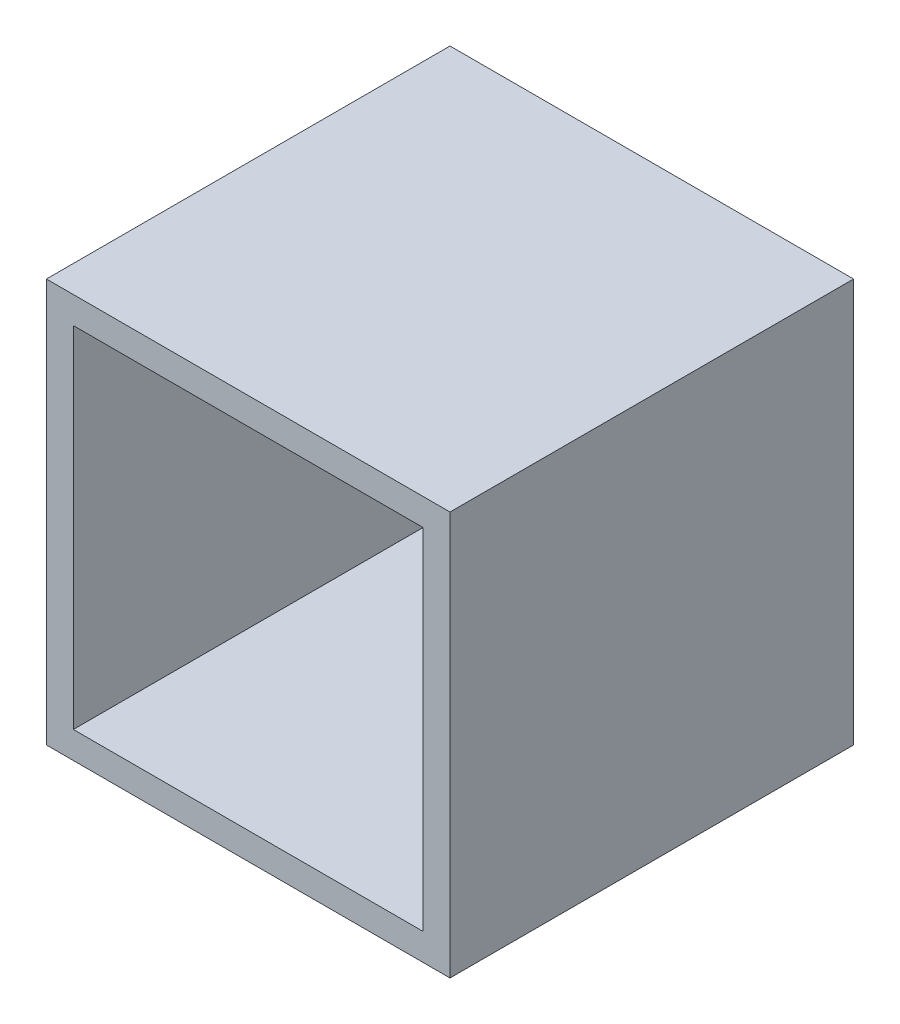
ISO-10303-21;
HEADER;
FILE_DESCRIPTION(('STEP AP214'),'2;1');
FILE_NAME('part.step','',(''),(''),'','','');
FILE_SCHEMA(('AUTOMOTIVE_DESIGN { 1 0 10303 214 1 1 1 1 }'));
ENDSEC;
DATA;
#1=APPLICATION_CONTEXT('core data for automotive mechanical design processes');
#2=APPLICATION_PROTOCOL_DEFINITION('international standard','automotive_design',2000,#1);
#3=PRODUCT_CONTEXT('',#1,'mechanical');
#4=PRODUCT('Part','Part','',(#3));
#5=PRODUCT_RELATED_PRODUCT_CATEGORY('part','',(#4));
#6=PRODUCT_DEFINITION_FORMATION('','',#4);
#7=PRODUCT_DEFINITION_CONTEXT('part definition',#1,'design');
#8=PRODUCT_DEFINITION('design','',#6,#7);
#9=PRODUCT_DEFINITION_SHAPE('','',#8);
#10=(LENGTH_UNIT() NAMED_UNIT(*) SI_UNIT(.MILLI.,.METRE.));
#11=(NAMED_UNIT(*) PLANE_ANGLE_UNIT() SI_UNIT($,.RADIAN.));
#12=(NAMED_UNIT(*) SI_UNIT($,.STERADIAN.) SOLID_ANGLE_UNIT());
#13=UNCERTAINTY_MEASURE_WITH_UNIT(LENGTH_MEASURE(1.E-05),#10,'distance_accuracy_value','');
#14=(GEOMETRIC_REPRESENTATION_CONTEXT(3) GLOBAL_UNCERTAINTY_ASSIGNED_CONTEXT((#13)) GLOBAL_UNIT_ASSIGNED_CONTEXT((#10,
#11,#12)) REPRESENTATION_CONTEXT('',''));
#15=CARTESIAN_POINT('',(0.,0.,0.));
#16=DIRECTION('',(0.,0.,1.));
#17=DIRECTION('',(1.,0.,0.));
#18=AXIS2_PLACEMENT_3D('',#15,#16,#17);
#19=CARTESIAN_POINT('',(0.,0.,300.));
#20=DIRECTION('',(0.,0.,1.));
#21=DIRECTION('',(1.,0.,0.));
#22=AXIS2_PLACEMENT_3D('',#19,#20,#21);
#23=PLANE('',#22);
#24=DIRECTION('',(0.,1.,0.));
#25=VECTOR('',#24,1.);
#26=CARTESIAN_POINT('',(150.,-150.,300.));
#27=LINE('',#26,#25);
#28=CARTESIAN_POINT('',(150.,-150.,300.));
#29=VERTEX_POINT('',#28);
#30=CARTESIAN_POINT('',(150.,150.,300.));
#31=VERTEX_POINT('',#30);
#32=EDGE_CURVE('E137',#29,#31,#27,.T.);
#33=ORIENTED_EDGE('',*,*,#32,.T.);
#34=DIRECTION('',(-1.,0.,0.));
#35=VECTOR('',#34,1.);
#36=CARTESIAN_POINT('',(-150.,150.,300.));
#37=LINE('',#36,#35);
#38=CARTESIAN_POINT('',(-150.,150.,300.));
#39=VERTEX_POINT('',#38);
#40=EDGE_CURVE('E140',#31,#39,#37,.T.);
#41=ORIENTED_EDGE('',*,*,#40,.T.);
#42=DIRECTION('',(0.,-1.,0.));
#43=VECTOR('',#42,1.);
#44=CARTESIAN_POINT('',(-150.,-150.,300.));
#45=LINE('',#44,#43);
#46=CARTESIAN_POINT('',(-150.,-150.,300.));
#47=VERTEX_POINT('',#46);
#48=EDGE_CURVE('E143',#39,#47,#45,.T.);
#49=ORIENTED_EDGE('',*,*,#48,.T.);
#50=DIRECTION('',(1.,0.,0.));
#51=VECTOR('',#50,1.);
#52=CARTESIAN_POINT('',(-150.,-150.,300.));
#53=LINE('',#52,#51);
#54=EDGE_CURVE('E145',#47,#29,#53,.T.);
#55=ORIENTED_EDGE('',*,*,#54,.T.);
#56=EDGE_LOOP('',(#33,#41,#49,#55));
#57=FACE_BOUND('',#56,.T.);
#58=DIRECTION('',(-1.,0.,0.));
#59=VECTOR('',#58,1.);
#60=CARTESIAN_POINT('',(0.,130.,300.));
#61=LINE('',#60,#59);
#62=CARTESIAN_POINT('',(130.,130.,300.));
#63=VERTEX_POINT('',#62);
#64=CARTESIAN_POINT('',(-130.,130.,300.));
#65=VERTEX_POINT('',#64);
#66=EDGE_CURVE('E106',#63,#65,#61,.T.);
#67=ORIENTED_EDGE('',*,*,#66,.F.);
#68=DIRECTION('',(0.,1.,0.));
#69=VECTOR('',#68,1.);
#70=CARTESIAN_POINT('',(130.,0.,300.));
#71=LINE('',#70,#69);
#72=CARTESIAN_POINT('',(130.,-130.,300.));
#73=VERTEX_POINT('',#72);
#74=EDGE_CURVE('E98',#73,#63,#71,.T.);
#75=ORIENTED_EDGE('',*,*,#74,.F.);
#76=DIRECTION('',(1.,0.,0.));
#77=VECTOR('',#76,1.);
#78=CARTESIAN_POINT('',(0.,-130.,300.));
#79=LINE('',#78,#77);
#80=CARTESIAN_POINT('',(-130.,-130.,300.));
#81=VERTEX_POINT('',#80);
#82=EDGE_CURVE('E121',#81,#73,#79,.T.);
#83=ORIENTED_EDGE('',*,*,#82,.F.);
#84=DIRECTION('',(0.,-1.,0.));
#85=VECTOR('',#84,1.);
#86=CARTESIAN_POINT('',(-130.,0.,300.));
#87=LINE('',#86,#85);
#88=EDGE_CURVE('E119',#65,#81,#87,.T.);
#89=ORIENTED_EDGE('',*,*,#88,.F.);
#90=EDGE_LOOP('',(#67,#75,#83,#89));
#91=FACE_BOUND('',#90,.T.);
#92=ADVANCED_FACE('F34',(#57,#91),#23,.T.);
#93=CARTESIAN_POINT('',(0.,0.,0.));
#94=DIRECTION('',(0.,0.,1.));
#95=DIRECTION('',(1.,0.,0.));
#96=AXIS2_PLACEMENT_3D('',#93,#94,#95);
#97=PLANE('',#96);
#98=DIRECTION('',(0.,1.,0.));
#99=VECTOR('',#98,1.);
#100=CARTESIAN_POINT('',(150.,-150.,0.));
#101=LINE('',#100,#99);
#102=CARTESIAN_POINT('',(150.,-150.,0.));
#103=VERTEX_POINT('',#102);
#104=CARTESIAN_POINT('',(150.,150.,0.));
#105=VERTEX_POINT('',#104);
#106=EDGE_CURVE('E115',#103,#105,#101,.T.);
#107=ORIENTED_EDGE('',*,*,#106,.F.);
#108=DIRECTION('',(1.,0.,0.));
#109=VECTOR('',#108,1.);
#110=CARTESIAN_POINT('',(-150.,-150.,0.));
#111=LINE('',#110,#109);
#112=CARTESIAN_POINT('',(-150.,-150.,0.));
#113=VERTEX_POINT('',#112);
#114=EDGE_CURVE('E141',#113,#103,#111,.T.);
#115=ORIENTED_EDGE('',*,*,#114,.F.);
#116=DIRECTION('',(0.,-1.,0.));
#117=VECTOR('',#116,1.);
#118=CARTESIAN_POINT('',(-150.,-150.,0.));
#119=LINE('',#118,#117);
#120=CARTESIAN_POINT('',(-150.,150.,0.));
#121=VERTEX_POINT('',#120);
#122=EDGE_CURVE('E152',#121,#113,#119,.T.);
#123=ORIENTED_EDGE('',*,*,#122,.F.);
#124=DIRECTION('',(-1.,0.,0.));
#125=VECTOR('',#124,1.);
#126=CARTESIAN_POINT('',(-150.,150.,0.));
#127=LINE('',#126,#125);
#128=EDGE_CURVE('E150',#105,#121,#127,.T.);
#129=ORIENTED_EDGE('',*,*,#128,.F.);
#130=EDGE_LOOP('',(#107,#115,#123,#129));
#131=FACE_BOUND('',#130,.T.);
#132=DIRECTION('',(0.,1.,0.));
#133=VECTOR('',#132,1.);
#134=CARTESIAN_POINT('',(130.,0.,0.));
#135=LINE('',#134,#133);
#136=CARTESIAN_POINT('',(130.,-130.,0.));
#137=VERTEX_POINT('',#136);
#138=CARTESIAN_POINT('',(130.,130.,0.));
#139=VERTEX_POINT('',#138);
#140=EDGE_CURVE('E57',#137,#139,#135,.T.);
#141=ORIENTED_EDGE('',*,*,#140,.T.);
#142=DIRECTION('',(-1.,0.,0.));
#143=VECTOR('',#142,1.);
#144=CARTESIAN_POINT('',(0.,130.,0.));
#145=LINE('',#144,#143);
#146=CARTESIAN_POINT('',(-130.,130.,0.));
#147=VERTEX_POINT('',#146);
#148=EDGE_CURVE('E114',#139,#147,#145,.T.);
#149=ORIENTED_EDGE('',*,*,#148,.T.);
#150=DIRECTION('',(0.,-1.,0.));
#151=VECTOR('',#150,1.);
#152=CARTESIAN_POINT('',(-130.,0.,0.));
#153=LINE('',#152,#151);
#154=CARTESIAN_POINT('',(-130.,-130.,0.));
#155=VERTEX_POINT('',#154);
#156=EDGE_CURVE('E129',#147,#155,#153,.T.);
#157=ORIENTED_EDGE('',*,*,#156,.T.);
#158=DIRECTION('',(1.,0.,0.));
#159=VECTOR('',#158,1.);
#160=CARTESIAN_POINT('',(0.,-130.,0.));
#161=LINE('',#160,#159);
#162=EDGE_CURVE('E107',#155,#137,#161,.T.);
#163=ORIENTED_EDGE('',*,*,#162,.T.);
#164=EDGE_LOOP('',(#141,#149,#157,#163));
#165=FACE_BOUND('',#164,.T.);
#166=ADVANCED_FACE('F170',(#131,#165),#97,.F.);
#167=CARTESIAN_POINT('',(150.,-150.,300.));
#168=DIRECTION('',(-1.,0.,0.));
#169=DIRECTION('',(0.,0.,1.));
#170=AXIS2_PLACEMENT_3D('',#167,#168,#169);
#171=PLANE('',#170);
#172=ORIENTED_EDGE('',*,*,#106,.T.);
#173=DIRECTION('',(0.,0.,-1.));
#174=VECTOR('',#173,1.);
#175=CARTESIAN_POINT('',(150.,150.,300.));
#176=LINE('',#175,#174);
#177=EDGE_CURVE('E11',#31,#105,#176,.T.);
#178=ORIENTED_EDGE('',*,*,#177,.F.);
#179=ORIENTED_EDGE('',*,*,#32,.F.);
#180=DIRECTION('',(0.,0.,-1.));
#181=VECTOR('',#180,1.);
#182=CARTESIAN_POINT('',(150.,-150.,300.));
#183=LINE('',#182,#181);
#184=EDGE_CURVE('E147',#29,#103,#183,.T.);
#185=ORIENTED_EDGE('',*,*,#184,.T.);
#186=EDGE_LOOP('',(#172,#178,#179,#185));
#187=FACE_BOUND('',#186,.T.);
#188=ADVANCED_FACE('F36',(#187),#171,.F.);
#189=CARTESIAN_POINT('',(-150.,150.,300.));
#190=DIRECTION('',(0.,-1.,0.));
#191=DIRECTION('',(0.,0.,-1.));
#192=AXIS2_PLACEMENT_3D('',#189,#190,#191);
#193=PLANE('',#192);
#194=ORIENTED_EDGE('',*,*,#128,.T.);
#195=DIRECTION('',(0.,0.,-1.));
#196=VECTOR('',#195,1.);
#197=CARTESIAN_POINT('',(-150.,150.,300.));
#198=LINE('',#197,#196);
#199=EDGE_CURVE('E42',#39,#121,#198,.T.);
#200=ORIENTED_EDGE('',*,*,#199,.F.);
#201=ORIENTED_EDGE('',*,*,#40,.F.);
#202=ORIENTED_EDGE('',*,*,#177,.T.);
#203=EDGE_LOOP('',(#194,#200,#201,#202));
#204=FACE_BOUND('',#203,.T.);
#205=ADVANCED_FACE('F180',(#204),#193,.F.);
#206=CARTESIAN_POINT('',(-150.,-150.,300.));
#207=DIRECTION('',(1.,0.,0.));
#208=DIRECTION('',(0.,0.,-1.));
#209=AXIS2_PLACEMENT_3D('',#206,#207,#208);
#210=PLANE('',#209);
#211=ORIENTED_EDGE('',*,*,#122,.T.);
#212=DIRECTION('',(0.,0.,-1.));
#213=VECTOR('',#212,1.);
#214=CARTESIAN_POINT('',(-150.,-150.,300.));
#215=LINE('',#214,#213);
#216=EDGE_CURVE('E157',#47,#113,#215,.T.);
#217=ORIENTED_EDGE('',*,*,#216,.F.);
#218=ORIENTED_EDGE('',*,*,#48,.F.);
#219=ORIENTED_EDGE('',*,*,#199,.T.);
#220=EDGE_LOOP('',(#211,#217,#218,#219));
#221=FACE_BOUND('',#220,.T.);
#222=ADVANCED_FACE('F164',(#221),#210,.F.);
#223=CARTESIAN_POINT('',(-150.,-150.,300.));
#224=DIRECTION('',(0.,1.,0.));
#225=DIRECTION('',(0.,0.,1.));
#226=AXIS2_PLACEMENT_3D('',#223,#224,#225);
#227=PLANE('',#226);
#228=ORIENTED_EDGE('',*,*,#114,.T.);
#229=ORIENTED_EDGE('',*,*,#184,.F.);
#230=ORIENTED_EDGE('',*,*,#54,.F.);
#231=ORIENTED_EDGE('',*,*,#216,.T.);
#232=EDGE_LOOP('',(#228,#229,#230,#231));
#233=FACE_BOUND('',#232,.T.);
#234=ADVANCED_FACE('F174',(#233),#227,.F.);
#235=CARTESIAN_POINT('',(130.,0.,300.));
#236=DIRECTION('',(-1.,0.,0.));
#237=DIRECTION('',(0.,0.,1.));
#238=AXIS2_PLACEMENT_3D('',#235,#236,#237);
#239=PLANE('',#238);
#240=CARTESIAN_POINT('',(130.,-96.0734375,37.56));
#241=DIRECTION('',(1.,0.,0.));
#242=DIRECTION('',(0.,0.,1.));
#243=AXIS2_PLACEMENT_3D('',#240,#241,#242);
#244=CIRCLE('',#243,1.25);
#245=CARTESIAN_POINT('',(130.,-96.0734375,38.81));
#246=VERTEX_POINT('',#245);
#247=EDGE_CURVE('E212',#246,#246,#244,.T.);
#248=ORIENTED_EDGE('',*,*,#247,.T.);
#249=EDGE_LOOP('',(#248));
#250=FACE_BOUND('',#249,.T.);
#251=CARTESIAN_POINT('',(130.,-63.9265625,37.56));
#252=DIRECTION('',(1.,0.,0.));
#253=DIRECTION('',(0.,0.,1.));
#254=AXIS2_PLACEMENT_3D('',#251,#252,#253);
#255=CIRCLE('',#254,1.25);
#256=CARTESIAN_POINT('',(130.,-63.9265625,38.81));
#257=VERTEX_POINT('',#256);
#258=EDGE_CURVE('E216',#257,#257,#255,.T.);
#259=ORIENTED_EDGE('',*,*,#258,.T.);
#260=EDGE_LOOP('',(#259));
#261=FACE_BOUND('',#260,.T.);
#262=CARTESIAN_POINT('',(130.,63.9265625,37.56));
#263=DIRECTION('',(-1.,0.,0.));
#264=DIRECTION('',(0.,0.,1.));
#265=AXIS2_PLACEMENT_3D('',#262,#263,#264);
#266=CIRCLE('',#265,1.25);
#267=CARTESIAN_POINT('',(130.,63.9265625,38.81));
#268=VERTEX_POINT('',#267);
#269=EDGE_CURVE('E220',#268,#268,#266,.T.);
#270=ORIENTED_EDGE('',*,*,#269,.F.);
#271=EDGE_LOOP('',(#270));
#272=FACE_BOUND('',#271,.T.);
#273=CARTESIAN_POINT('',(130.,96.0734375,37.56));
#274=DIRECTION('',(-1.,0.,0.));
#275=DIRECTION('',(0.,0.,1.));
#276=AXIS2_PLACEMENT_3D('',#273,#274,#275);
#277=CIRCLE('',#276,1.25);
#278=CARTESIAN_POINT('',(130.,96.0734375,38.81));
#279=VERTEX_POINT('',#278);
#280=EDGE_CURVE('E223',#279,#279,#277,.T.);
#281=ORIENTED_EDGE('',*,*,#280,.F.);
#282=EDGE_LOOP('',(#281));
#283=FACE_BOUND('',#282,.T.);
#284=ORIENTED_EDGE('',*,*,#140,.F.);
#285=DIRECTION('',(0.,0.,-1.));
#286=VECTOR('',#285,1.);
#287=CARTESIAN_POINT('',(130.,-130.,300.));
#288=LINE('',#287,#286);
#289=EDGE_CURVE('E102',#73,#137,#288,.T.);
#290=ORIENTED_EDGE('',*,*,#289,.F.);
#291=ORIENTED_EDGE('',*,*,#74,.T.);
#292=DIRECTION('',(0.,0.,-1.));
#293=VECTOR('',#292,1.);
#294=CARTESIAN_POINT('',(130.,130.,300.));
#295=LINE('',#294,#293);
#296=EDGE_CURVE('E101',#63,#139,#295,.T.);
#297=ORIENTED_EDGE('',*,*,#296,.T.);
#298=EDGE_LOOP('',(#284,#290,#291,#297));
#299=FACE_BOUND('',#298,.T.);
#300=ADVANCED_FACE('F100',(#250,#261,#272,#283,#299),#239,.T.);
#301=CARTESIAN_POINT('',(0.,130.,300.));
#302=DIRECTION('',(0.,-1.,0.));
#303=DIRECTION('',(0.,0.,-1.));
#304=AXIS2_PLACEMENT_3D('',#301,#302,#303);
#305=PLANE('',#304);
#306=ORIENTED_EDGE('',*,*,#148,.F.);
#307=ORIENTED_EDGE('',*,*,#296,.F.);
#308=ORIENTED_EDGE('',*,*,#66,.T.);
#309=DIRECTION('',(0.,0.,-1.));
#310=VECTOR('',#309,1.);
#311=CARTESIAN_POINT('',(-130.,130.,300.));
#312=LINE('',#311,#310);
#313=EDGE_CURVE('E116',#65,#147,#312,.T.);
#314=ORIENTED_EDGE('',*,*,#313,.T.);
#315=EDGE_LOOP('',(#306,#307,#308,#314));
#316=FACE_BOUND('',#315,.T.);
#317=ADVANCED_FACE('F111',(#316),#305,.T.);
#318=CARTESIAN_POINT('',(-130.,0.,300.));
#319=DIRECTION('',(1.,0.,0.));
#320=DIRECTION('',(0.,0.,-1.));
#321=AXIS2_PLACEMENT_3D('',#318,#319,#320);
#322=PLANE('',#321);
#323=ORIENTED_EDGE('',*,*,#156,.F.);
#324=ORIENTED_EDGE('',*,*,#313,.F.);
#325=ORIENTED_EDGE('',*,*,#88,.T.);
#326=DIRECTION('',(0.,0.,-1.));
#327=VECTOR('',#326,1.);
#328=CARTESIAN_POINT('',(-130.,-130.,300.));
#329=LINE('',#328,#327);
#330=EDGE_CURVE('E49',#81,#155,#329,.T.);
#331=ORIENTED_EDGE('',*,*,#330,.T.);
#332=EDGE_LOOP('',(#323,#324,#325,#331));
#333=FACE_BOUND('',#332,.T.);
#334=ADVANCED_FACE('F208',(#333),#322,.T.);
#335=CARTESIAN_POINT('',(0.,-130.,300.));
#336=DIRECTION('',(0.,1.,0.));
#337=DIRECTION('',(0.,0.,1.));
#338=AXIS2_PLACEMENT_3D('',#335,#336,#337);
#339=PLANE('',#338);
#340=ORIENTED_EDGE('',*,*,#162,.F.);
#341=ORIENTED_EDGE('',*,*,#330,.F.);
#342=ORIENTED_EDGE('',*,*,#82,.T.);
#343=ORIENTED_EDGE('',*,*,#289,.T.);
#344=EDGE_LOOP('',(#340,#341,#342,#343));
#345=FACE_BOUND('',#344,.T.);
#346=ADVANCED_FACE('F275',(#345),#339,.T.);
#347=CARTESIAN_POINT('',(140.,96.0734375,37.56));
#348=DIRECTION('',(-1.,0.,0.));
#349=DIRECTION('',(0.,0.,1.));
#350=AXIS2_PLACEMENT_3D('',#347,#348,#349);
#351=CYLINDRICAL_SURFACE('',#350,1.25);
#352=CARTESIAN_POINT('',(140.,96.0734375,37.56));
#353=DIRECTION('',(-1.,0.,0.));
#354=DIRECTION('',(0.,0.,1.));
#355=AXIS2_PLACEMENT_3D('',#352,#353,#354);
#356=CIRCLE('',#355,1.25);
#357=CARTESIAN_POINT('',(140.,96.0734375,38.81));
#358=VERTEX_POINT('',#357);
#359=EDGE_CURVE('E225',#358,#358,#356,.T.);
#360=ORIENTED_EDGE('',*,*,#359,.F.);
#361=EDGE_LOOP('',(#360));
#362=FACE_BOUND('',#361,.T.);
#363=ORIENTED_EDGE('',*,*,#280,.T.);
#364=EDGE_LOOP('',(#363));
#365=FACE_BOUND('',#364,.T.);
#366=ADVANCED_FACE('F271',(#362,#365),#351,.F.);
#367=CARTESIAN_POINT('',(140.,96.0734375,37.56));
#368=DIRECTION('',(-1.,0.,0.));
#369=DIRECTION('',(0.,0.,1.));
#370=AXIS2_PLACEMENT_3D('',#367,#368,#369);
#371=PLANE('',#370);
#372=ORIENTED_EDGE('',*,*,#359,.T.);
#373=EDGE_LOOP('',(#372));
#374=FACE_BOUND('',#373,.T.);
#375=ADVANCED_FACE('F267',(#374),#371,.T.);
#376=CARTESIAN_POINT('',(140.,63.9265625,37.56));
#377=DIRECTION('',(-1.,0.,0.));
#378=DIRECTION('',(0.,0.,1.));
#379=AXIS2_PLACEMENT_3D('',#376,#377,#378);
#380=CYLINDRICAL_SURFACE('',#379,1.25);
#381=CARTESIAN_POINT('',(140.,63.9265625,37.56));
#382=DIRECTION('',(-1.,0.,0.));
#383=DIRECTION('',(0.,0.,1.));
#384=AXIS2_PLACEMENT_3D('',#381,#382,#383);
#385=CIRCLE('',#384,1.25);
#386=CARTESIAN_POINT('',(140.,63.9265625,38.81));
#387=VERTEX_POINT('',#386);
#388=EDGE_CURVE('E127',#387,#387,#385,.T.);
#389=ORIENTED_EDGE('',*,*,#388,.F.);
#390=EDGE_LOOP('',(#389));
#391=FACE_BOUND('',#390,.T.);
#392=ORIENTED_EDGE('',*,*,#269,.T.);
#393=EDGE_LOOP('',(#392));
#394=FACE_BOUND('',#393,.T.);
#395=ADVANCED_FACE('F263',(#391,#394),#380,.F.);
#396=CARTESIAN_POINT('',(140.,63.9265625,37.56));
#397=DIRECTION('',(-1.,0.,0.));
#398=DIRECTION('',(0.,0.,1.));
#399=AXIS2_PLACEMENT_3D('',#396,#397,#398);
#400=PLANE('',#399);
#401=ORIENTED_EDGE('',*,*,#388,.T.);
#402=EDGE_LOOP('',(#401));
#403=FACE_BOUND('',#402,.T.);
#404=ADVANCED_FACE('F259',(#403),#400,.T.);
#405=CARTESIAN_POINT('',(140.,-63.9265625,37.56));
#406=DIRECTION('',(-1.,0.,0.));
#407=DIRECTION('',(0.,0.,1.));
#408=AXIS2_PLACEMENT_3D('',#405,#406,#407);
#409=CYLINDRICAL_SURFACE('',#408,1.25);
#410=CARTESIAN_POINT('',(140.,-63.9265625,37.56));
#411=DIRECTION('',(1.,0.,0.));
#412=DIRECTION('',(0.,0.,1.));
#413=AXIS2_PLACEMENT_3D('',#410,#411,#412);
#414=CIRCLE('',#413,1.25);
#415=CARTESIAN_POINT('',(140.,-63.9265625,38.81));
#416=VERTEX_POINT('',#415);
#417=EDGE_CURVE('E226',#416,#416,#414,.T.);
#418=ORIENTED_EDGE('',*,*,#417,.T.);
#419=EDGE_LOOP('',(#418));
#420=FACE_BOUND('',#419,.T.);
#421=ORIENTED_EDGE('',*,*,#258,.F.);
#422=EDGE_LOOP('',(#421));
#423=FACE_BOUND('',#422,.T.);
#424=ADVANCED_FACE('F255',(#420,#423),#409,.F.);
#425=CARTESIAN_POINT('',(140.,-63.9265625,37.56));
#426=DIRECTION('',(-1.,0.,0.));
#427=DIRECTION('',(0.,0.,1.));
#428=AXIS2_PLACEMENT_3D('',#425,#426,#427);
#429=PLANE('',#428);
#430=ORIENTED_EDGE('',*,*,#417,.F.);
#431=EDGE_LOOP('',(#430));
#432=FACE_BOUND('',#431,.T.);
#433=ADVANCED_FACE('F250',(#432),#429,.T.);
#434=CARTESIAN_POINT('',(140.,-96.0734375,37.56));
#435=DIRECTION('',(-1.,0.,0.));
#436=DIRECTION('',(0.,0.,1.));
#437=AXIS2_PLACEMENT_3D('',#434,#435,#436);
#438=CYLINDRICAL_SURFACE('',#437,1.25);
#439=CARTESIAN_POINT('',(140.,-96.0734375,37.56));
#440=DIRECTION('',(1.,0.,0.));
#441=DIRECTION('',(0.,0.,1.));
#442=AXIS2_PLACEMENT_3D('',#439,#440,#441);
#443=CIRCLE('',#442,1.25);
#444=CARTESIAN_POINT('',(140.,-96.0734375,38.81));
#445=VERTEX_POINT('',#444);
#446=EDGE_CURVE('E236',#445,#445,#443,.T.);
#447=ORIENTED_EDGE('',*,*,#446,.T.);
#448=EDGE_LOOP('',(#447));
#449=FACE_BOUND('',#448,.T.);
#450=ORIENTED_EDGE('',*,*,#247,.F.);
#451=EDGE_LOOP('',(#450));
#452=FACE_BOUND('',#451,.T.);
#453=ADVANCED_FACE('F241',(#449,#452),#438,.F.);
#454=CARTESIAN_POINT('',(140.,-96.0734375,37.56));
#455=DIRECTION('',(-1.,0.,0.));
#456=DIRECTION('',(0.,0.,1.));
#457=AXIS2_PLACEMENT_3D('',#454,#455,#456);
#458=PLANE('',#457);
#459=ORIENTED_EDGE('',*,*,#446,.F.);
#460=EDGE_LOOP('',(#459));
#461=FACE_BOUND('',#460,.T.);
#462=ADVANCED_FACE('F244',(#461),#458,.T.);
#463=CLOSED_SHELL('',(#92,#166,#188,#205,#222,#234,#300,#317,#334,#346,#366,#375,#395,#404,#424,
#433,#453,#462));
#464=MANIFOLD_SOLID_BREP('B2',#463);
#465=ADVANCED_BREP_SHAPE_REPRESENTATION('',(#18,#464),#14);
#466=SHAPE_DEFINITION_REPRESENTATION(#9,#465);
ENDSEC;
END-ISO-10303-21;
